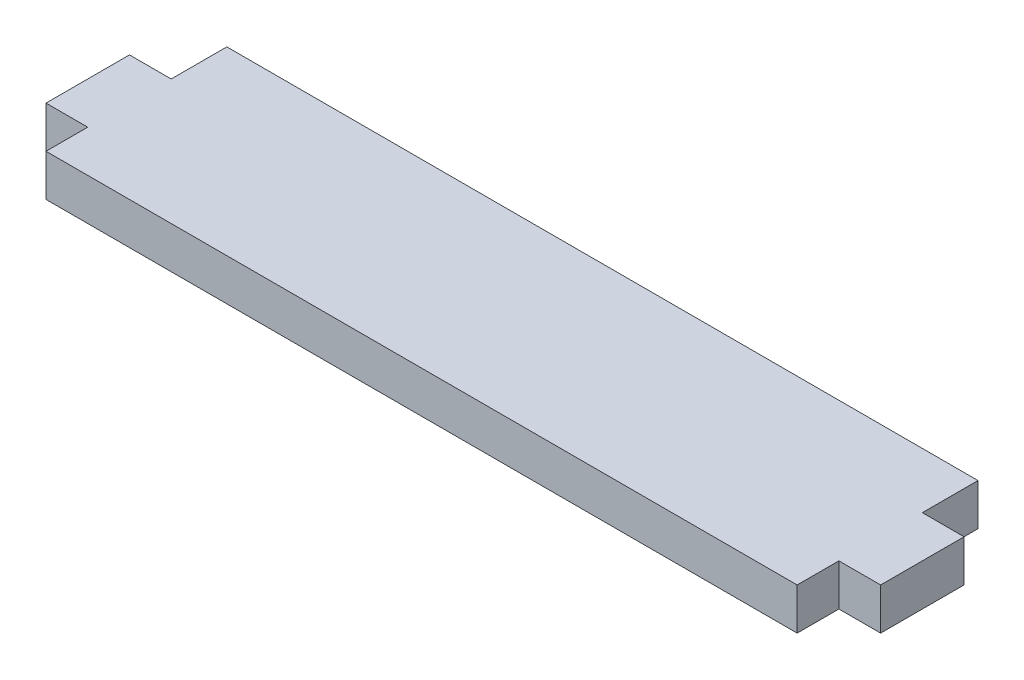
ISO-10303-21;
HEADER;
FILE_DESCRIPTION(('STEP AP214'),'2;1');
FILE_NAME('part.step','',(''),(''),'','','');
FILE_SCHEMA(('AUTOMOTIVE_DESIGN { 1 0 10303 214 1 1 1 1 }'));
ENDSEC;
DATA;
#1=APPLICATION_CONTEXT('core data for automotive mechanical design processes');
#2=APPLICATION_PROTOCOL_DEFINITION('international standard','automotive_design',2000,#1);
#3=PRODUCT_CONTEXT('',#1,'mechanical');
#4=PRODUCT('Part','Part','',(#3));
#5=PRODUCT_RELATED_PRODUCT_CATEGORY('part','',(#4));
#6=PRODUCT_DEFINITION_FORMATION('','',#4);
#7=PRODUCT_DEFINITION_CONTEXT('part definition',#1,'design');
#8=PRODUCT_DEFINITION('design','',#6,#7);
#9=PRODUCT_DEFINITION_SHAPE('','',#8);
#10=(LENGTH_UNIT() NAMED_UNIT(*) SI_UNIT(.MILLI.,.METRE.));
#11=(NAMED_UNIT(*) PLANE_ANGLE_UNIT() SI_UNIT($,.RADIAN.));
#12=(NAMED_UNIT(*) SI_UNIT($,.STERADIAN.) SOLID_ANGLE_UNIT());
#13=UNCERTAINTY_MEASURE_WITH_UNIT(LENGTH_MEASURE(1.E-05),#10,'distance_accuracy_value','');
#14=(GEOMETRIC_REPRESENTATION_CONTEXT(3) GLOBAL_UNCERTAINTY_ASSIGNED_CONTEXT((#13)) GLOBAL_UNIT_ASSIGNED_CONTEXT((#10,
#11,#12)) REPRESENTATION_CONTEXT('',''));
#15=CARTESIAN_POINT('',(0.,0.,0.));
#16=DIRECTION('',(0.,0.,1.));
#17=DIRECTION('',(1.,0.,0.));
#18=AXIS2_PLACEMENT_3D('',#15,#16,#17);
#19=CARTESIAN_POINT('',(27.,3.,-6.5));
#20=DIRECTION('',(-1.,0.,0.));
#21=DIRECTION('',(0.,0.,1.));
#22=AXIS2_PLACEMENT_3D('',#19,#20,#21);
#23=PLANE('',#22);
#24=DIRECTION('',(0.,-1.,0.));
#25=VECTOR('',#24,1.);
#26=CARTESIAN_POINT('',(27.,3.,3.5));
#27=LINE('',#26,#25);
#28=CARTESIAN_POINT('',(27.,3.,3.5));
#29=VERTEX_POINT('',#28);
#30=CARTESIAN_POINT('',(27.,0.,3.5));
#31=VERTEX_POINT('',#30);
#32=EDGE_CURVE('E151',#29,#31,#27,.T.);
#33=ORIENTED_EDGE('',*,*,#32,.F.);
#34=DIRECTION('',(0.,0.,-1.));
#35=VECTOR('',#34,1.);
#36=CARTESIAN_POINT('',(27.,3.,-6.5));
#37=LINE('',#36,#35);
#38=CARTESIAN_POINT('',(27.,3.,6.5));
#39=VERTEX_POINT('',#38);
#40=EDGE_CURVE('E197',#39,#29,#37,.T.);
#41=ORIENTED_EDGE('',*,*,#40,.F.);
#42=DIRECTION('',(0.,-1.,0.));
#43=VECTOR('',#42,1.);
#44=CARTESIAN_POINT('',(27.,3.,6.5));
#45=LINE('',#44,#43);
#46=CARTESIAN_POINT('',(27.,0.,6.5));
#47=VERTEX_POINT('',#46);
#48=EDGE_CURVE('E224',#39,#47,#45,.T.);
#49=ORIENTED_EDGE('',*,*,#48,.T.);
#50=DIRECTION('',(0.,0.,-1.));
#51=VECTOR('',#50,1.);
#52=CARTESIAN_POINT('',(27.,0.,-6.5));
#53=LINE('',#52,#51);
#54=EDGE_CURVE('E201',#47,#31,#53,.T.);
#55=ORIENTED_EDGE('',*,*,#54,.T.);
#56=EDGE_LOOP('',(#33,#41,#49,#55));
#57=FACE_BOUND('',#56,.T.);
#58=ADVANCED_FACE('F33',(#57),#23,.F.);
#59=CARTESIAN_POINT('',(-27.,3.,-6.5));
#60=DIRECTION('',(1.,0.,0.));
#61=DIRECTION('',(0.,0.,-1.));
#62=AXIS2_PLACEMENT_3D('',#59,#60,#61);
#63=PLANE('',#62);
#64=DIRECTION('',(0.,-1.,0.));
#65=VECTOR('',#64,1.);
#66=CARTESIAN_POINT('',(-27.,3.,-2.5));
#67=LINE('',#66,#65);
#68=CARTESIAN_POINT('',(-27.,3.,-2.5));
#69=VERTEX_POINT('',#68);
#70=CARTESIAN_POINT('',(-27.,0.,-2.5));
#71=VERTEX_POINT('',#70);
#72=EDGE_CURVE('E182',#69,#71,#67,.T.);
#73=ORIENTED_EDGE('',*,*,#72,.F.);
#74=DIRECTION('',(0.,0.,1.));
#75=VECTOR('',#74,1.);
#76=CARTESIAN_POINT('',(-27.,3.,-6.5));
#77=LINE('',#76,#75);
#78=CARTESIAN_POINT('',(-27.,3.,-6.5));
#79=VERTEX_POINT('',#78);
#80=EDGE_CURVE('E231',#79,#69,#77,.T.);
#81=ORIENTED_EDGE('',*,*,#80,.F.);
#82=DIRECTION('',(0.,-1.,0.));
#83=VECTOR('',#82,1.);
#84=CARTESIAN_POINT('',(-27.,3.,-6.5));
#85=LINE('',#84,#83);
#86=CARTESIAN_POINT('',(-27.,0.,-6.5));
#87=VERTEX_POINT('',#86);
#88=EDGE_CURVE('E42',#79,#87,#85,.T.);
#89=ORIENTED_EDGE('',*,*,#88,.T.);
#90=DIRECTION('',(0.,0.,1.));
#91=VECTOR('',#90,1.);
#92=CARTESIAN_POINT('',(-27.,0.,-6.5));
#93=LINE('',#92,#91);
#94=EDGE_CURVE('E217',#87,#71,#93,.T.);
#95=ORIENTED_EDGE('',*,*,#94,.T.);
#96=EDGE_LOOP('',(#73,#81,#89,#95));
#97=FACE_BOUND('',#96,.T.);
#98=ADVANCED_FACE('F248',(#97),#63,.F.);
#99=CARTESIAN_POINT('',(27.,3.,-2.5));
#100=VERTEX_POINT('',#99);
#101=CARTESIAN_POINT('',(27.,3.,-6.5));
#102=VERTEX_POINT('',#101);
#103=EDGE_CURVE('E195',#100,#102,#37,.T.);
#104=ORIENTED_EDGE('',*,*,#103,.F.);
#105=DIRECTION('',(0.,-1.,0.));
#106=VECTOR('',#105,1.);
#107=CARTESIAN_POINT('',(27.,3.,-2.5));
#108=LINE('',#107,#106);
#109=CARTESIAN_POINT('',(27.,0.,-2.5));
#110=VERTEX_POINT('',#109);
#111=EDGE_CURVE('E130',#100,#110,#108,.T.);
#112=ORIENTED_EDGE('',*,*,#111,.T.);
#113=CARTESIAN_POINT('',(27.,0.,-6.5));
#114=VERTEX_POINT('',#113);
#115=EDGE_CURVE('E185',#110,#114,#53,.T.);
#116=ORIENTED_EDGE('',*,*,#115,.T.);
#117=DIRECTION('',(0.,-1.,0.));
#118=VECTOR('',#117,1.);
#119=CARTESIAN_POINT('',(27.,3.,-6.5));
#120=LINE('',#119,#118);
#121=EDGE_CURVE('E11',#102,#114,#120,.T.);
#122=ORIENTED_EDGE('',*,*,#121,.F.);
#123=EDGE_LOOP('',(#104,#112,#116,#122));
#124=FACE_BOUND('',#123,.T.);
#125=ADVANCED_FACE('F35',(#124),#23,.F.);
#126=CARTESIAN_POINT('',(-27.,3.,-6.5));
#127=DIRECTION('',(0.,0.,1.));
#128=DIRECTION('',(1.,0.,0.));
#129=AXIS2_PLACEMENT_3D('',#126,#127,#128);
#130=PLANE('',#129);
#131=DIRECTION('',(-1.,0.,0.));
#132=VECTOR('',#131,1.);
#133=CARTESIAN_POINT('',(-27.,0.,-6.5));
#134=LINE('',#133,#132);
#135=EDGE_CURVE('E206',#114,#87,#134,.T.);
#136=ORIENTED_EDGE('',*,*,#135,.T.);
#137=ORIENTED_EDGE('',*,*,#88,.F.);
#138=DIRECTION('',(-1.,0.,0.));
#139=VECTOR('',#138,1.);
#140=CARTESIAN_POINT('',(-27.,3.,-6.5));
#141=LINE('',#140,#139);
#142=EDGE_CURVE('E192',#102,#79,#141,.T.);
#143=ORIENTED_EDGE('',*,*,#142,.F.);
#144=ORIENTED_EDGE('',*,*,#121,.T.);
#145=EDGE_LOOP('',(#136,#137,#143,#144));
#146=FACE_BOUND('',#145,.T.);
#147=ADVANCED_FACE('F243',(#146),#130,.F.);
#148=CARTESIAN_POINT('',(-27.,3.,3.5));
#149=VERTEX_POINT('',#148);
#150=CARTESIAN_POINT('',(-27.,3.,6.5));
#151=VERTEX_POINT('',#150);
#152=EDGE_CURVE('E170',#149,#151,#77,.T.);
#153=ORIENTED_EDGE('',*,*,#152,.F.);
#154=DIRECTION('',(0.,-1.,0.));
#155=VECTOR('',#154,1.);
#156=CARTESIAN_POINT('',(-27.,3.,3.5));
#157=LINE('',#156,#155);
#158=CARTESIAN_POINT('',(-27.,0.,3.49999999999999));
#159=VERTEX_POINT('',#158);
#160=EDGE_CURVE('E167',#149,#159,#157,.T.);
#161=ORIENTED_EDGE('',*,*,#160,.T.);
#162=CARTESIAN_POINT('',(-27.,0.,6.5));
#163=VERTEX_POINT('',#162);
#164=EDGE_CURVE('E209',#159,#163,#93,.T.);
#165=ORIENTED_EDGE('',*,*,#164,.T.);
#166=DIRECTION('',(0.,-1.,0.));
#167=VECTOR('',#166,1.);
#168=CARTESIAN_POINT('',(-27.,3.,6.5));
#169=LINE('',#168,#167);
#170=EDGE_CURVE('E222',#151,#163,#169,.T.);
#171=ORIENTED_EDGE('',*,*,#170,.F.);
#172=EDGE_LOOP('',(#153,#161,#165,#171));
#173=FACE_BOUND('',#172,.T.);
#174=ADVANCED_FACE('F262',(#173),#63,.F.);
#175=CARTESIAN_POINT('',(-27.,3.,6.5));
#176=DIRECTION('',(0.,0.,-1.));
#177=DIRECTION('',(-1.,0.,0.));
#178=AXIS2_PLACEMENT_3D('',#175,#176,#177);
#179=PLANE('',#178);
#180=DIRECTION('',(1.,0.,0.));
#181=VECTOR('',#180,1.);
#182=CARTESIAN_POINT('',(-27.,0.,6.5));
#183=LINE('',#182,#181);
#184=EDGE_CURVE('E212',#163,#47,#183,.T.);
#185=ORIENTED_EDGE('',*,*,#184,.T.);
#186=ORIENTED_EDGE('',*,*,#48,.F.);
#187=DIRECTION('',(1.,0.,0.));
#188=VECTOR('',#187,1.);
#189=CARTESIAN_POINT('',(-27.,3.,6.5));
#190=LINE('',#189,#188);
#191=EDGE_CURVE('E205',#151,#39,#190,.T.);
#192=ORIENTED_EDGE('',*,*,#191,.F.);
#193=ORIENTED_EDGE('',*,*,#170,.T.);
#194=EDGE_LOOP('',(#185,#186,#192,#193));
#195=FACE_BOUND('',#194,.T.);
#196=ADVANCED_FACE('F265',(#195),#179,.F.);
#197=CARTESIAN_POINT('',(27.,3.,6.5));
#198=DIRECTION('',(0.,1.,0.));
#199=DIRECTION('',(0.,0.,1.));
#200=AXIS2_PLACEMENT_3D('',#197,#198,#199);
#201=PLANE('',#200);
#202=ORIENTED_EDGE('',*,*,#40,.T.);
#203=DIRECTION('',(1.,0.,0.));
#204=VECTOR('',#203,1.);
#205=CARTESIAN_POINT('',(30.,3.,3.5));
#206=LINE('',#205,#204);
#207=CARTESIAN_POINT('',(30.,3.,3.5));
#208=VERTEX_POINT('',#207);
#209=EDGE_CURVE('E133',#29,#208,#206,.T.);
#210=ORIENTED_EDGE('',*,*,#209,.T.);
#211=DIRECTION('',(0.,0.,-1.));
#212=VECTOR('',#211,1.);
#213=CARTESIAN_POINT('',(30.,3.,-2.5));
#214=LINE('',#213,#212);
#215=CARTESIAN_POINT('',(30.,3.,-2.5));
#216=VERTEX_POINT('',#215);
#217=EDGE_CURVE('E134',#208,#216,#214,.T.);
#218=ORIENTED_EDGE('',*,*,#217,.T.);
#219=DIRECTION('',(-1.,0.,0.));
#220=VECTOR('',#219,1.);
#221=CARTESIAN_POINT('',(30.,3.,-2.5));
#222=LINE('',#221,#220);
#223=EDGE_CURVE('E124',#216,#100,#222,.T.);
#224=ORIENTED_EDGE('',*,*,#223,.T.);
#225=ORIENTED_EDGE('',*,*,#103,.T.);
#226=ORIENTED_EDGE('',*,*,#142,.T.);
#227=ORIENTED_EDGE('',*,*,#80,.T.);
#228=DIRECTION('',(-1.,0.,0.));
#229=VECTOR('',#228,1.);
#230=CARTESIAN_POINT('',(-30.,3.,-2.5));
#231=LINE('',#230,#229);
#232=CARTESIAN_POINT('',(-30.,3.,-2.5));
#233=VERTEX_POINT('',#232);
#234=EDGE_CURVE('E160',#69,#233,#231,.T.);
#235=ORIENTED_EDGE('',*,*,#234,.T.);
#236=DIRECTION('',(0.,0.,1.));
#237=VECTOR('',#236,1.);
#238=CARTESIAN_POINT('',(-30.,3.,-2.5));
#239=LINE('',#238,#237);
#240=CARTESIAN_POINT('',(-30.,3.,3.5));
#241=VERTEX_POINT('',#240);
#242=EDGE_CURVE('E157',#233,#241,#239,.T.);
#243=ORIENTED_EDGE('',*,*,#242,.T.);
#244=DIRECTION('',(1.,0.,0.));
#245=VECTOR('',#244,1.);
#246=CARTESIAN_POINT('',(-30.,3.,3.5));
#247=LINE('',#246,#245);
#248=EDGE_CURVE('E159',#241,#149,#247,.T.);
#249=ORIENTED_EDGE('',*,*,#248,.T.);
#250=ORIENTED_EDGE('',*,*,#152,.T.);
#251=ORIENTED_EDGE('',*,*,#191,.T.);
#252=EDGE_LOOP('',(#202,#210,#218,#224,#225,#226,#227,#235,#243,#249,#250,#251));
#253=FACE_BOUND('',#252,.T.);
#254=ADVANCED_FACE('F138',(#253),#201,.T.);
#255=CARTESIAN_POINT('',(27.,0.,6.5));
#256=DIRECTION('',(0.,1.,0.));
#257=DIRECTION('',(0.,0.,1.));
#258=AXIS2_PLACEMENT_3D('',#255,#256,#257);
#259=PLANE('',#258);
#260=ORIENTED_EDGE('',*,*,#54,.F.);
#261=ORIENTED_EDGE('',*,*,#184,.F.);
#262=ORIENTED_EDGE('',*,*,#164,.F.);
#263=DIRECTION('',(1.,0.,0.));
#264=VECTOR('',#263,1.);
#265=CARTESIAN_POINT('',(-30.,0.,3.5));
#266=LINE('',#265,#264);
#267=CARTESIAN_POINT('',(-30.,0.,3.5));
#268=VERTEX_POINT('',#267);
#269=EDGE_CURVE('E58',#268,#159,#266,.T.);
#270=ORIENTED_EDGE('',*,*,#269,.F.);
#271=DIRECTION('',(0.,0.,1.));
#272=VECTOR('',#271,1.);
#273=CARTESIAN_POINT('',(-30.,0.,-2.5));
#274=LINE('',#273,#272);
#275=CARTESIAN_POINT('',(-30.,0.,-2.5));
#276=VERTEX_POINT('',#275);
#277=EDGE_CURVE('E149',#276,#268,#274,.T.);
#278=ORIENTED_EDGE('',*,*,#277,.F.);
#279=DIRECTION('',(-1.,0.,0.));
#280=VECTOR('',#279,1.);
#281=CARTESIAN_POINT('',(-30.,0.,-2.5));
#282=LINE('',#281,#280);
#283=EDGE_CURVE('E147',#71,#276,#282,.T.);
#284=ORIENTED_EDGE('',*,*,#283,.F.);
#285=ORIENTED_EDGE('',*,*,#94,.F.);
#286=ORIENTED_EDGE('',*,*,#135,.F.);
#287=ORIENTED_EDGE('',*,*,#115,.F.);
#288=DIRECTION('',(-1.,0.,0.));
#289=VECTOR('',#288,1.);
#290=CARTESIAN_POINT('',(30.,0.,-2.5));
#291=LINE('',#290,#289);
#292=CARTESIAN_POINT('',(30.,0.,-2.5));
#293=VERTEX_POINT('',#292);
#294=EDGE_CURVE('E50',#293,#110,#291,.T.);
#295=ORIENTED_EDGE('',*,*,#294,.F.);
#296=DIRECTION('',(0.,0.,-1.));
#297=VECTOR('',#296,1.);
#298=CARTESIAN_POINT('',(30.,0.,-2.5));
#299=LINE('',#298,#297);
#300=CARTESIAN_POINT('',(30.,0.,3.5));
#301=VERTEX_POINT('',#300);
#302=EDGE_CURVE('E146',#301,#293,#299,.T.);
#303=ORIENTED_EDGE('',*,*,#302,.F.);
#304=DIRECTION('',(1.,0.,0.));
#305=VECTOR('',#304,1.);
#306=CARTESIAN_POINT('',(30.,0.,3.5));
#307=LINE('',#306,#305);
#308=EDGE_CURVE('E142',#31,#301,#307,.T.);
#309=ORIENTED_EDGE('',*,*,#308,.F.);
#310=EDGE_LOOP('',(#260,#261,#262,#270,#278,#284,#285,#286,#287,#295,#303,#309));
#311=FACE_BOUND('',#310,.T.);
#312=ADVANCED_FACE('F284',(#311),#259,.F.);
#313=CARTESIAN_POINT('',(-30.,3.,-2.5));
#314=DIRECTION('',(0.,0.,1.));
#315=DIRECTION('',(1.,0.,0.));
#316=AXIS2_PLACEMENT_3D('',#313,#314,#315);
#317=PLANE('',#316);
#318=ORIENTED_EDGE('',*,*,#283,.T.);
#319=DIRECTION('',(0.,-1.,0.));
#320=VECTOR('',#319,1.);
#321=CARTESIAN_POINT('',(-30.,3.,-2.5));
#322=LINE('',#321,#320);
#323=EDGE_CURVE('E186',#233,#276,#322,.T.);
#324=ORIENTED_EDGE('',*,*,#323,.F.);
#325=ORIENTED_EDGE('',*,*,#234,.F.);
#326=ORIENTED_EDGE('',*,*,#72,.T.);
#327=EDGE_LOOP('',(#318,#324,#325,#326));
#328=FACE_BOUND('',#327,.T.);
#329=ADVANCED_FACE('F250',(#328),#317,.F.);
#330=CARTESIAN_POINT('',(-30.,3.,-2.5));
#331=DIRECTION('',(1.,0.,0.));
#332=DIRECTION('',(0.,0.,-1.));
#333=AXIS2_PLACEMENT_3D('',#330,#331,#332);
#334=PLANE('',#333);
#335=ORIENTED_EDGE('',*,*,#277,.T.);
#336=DIRECTION('',(0.,-1.,0.));
#337=VECTOR('',#336,1.);
#338=CARTESIAN_POINT('',(-30.,3.,3.5));
#339=LINE('',#338,#337);
#340=EDGE_CURVE('E164',#241,#268,#339,.T.);
#341=ORIENTED_EDGE('',*,*,#340,.F.);
#342=ORIENTED_EDGE('',*,*,#242,.F.);
#343=ORIENTED_EDGE('',*,*,#323,.T.);
#344=EDGE_LOOP('',(#335,#341,#342,#343));
#345=FACE_BOUND('',#344,.T.);
#346=ADVANCED_FACE('F257',(#345),#334,.F.);
#347=CARTESIAN_POINT('',(-30.,3.,3.5));
#348=DIRECTION('',(0.,0.,-1.));
#349=DIRECTION('',(-1.,0.,0.));
#350=AXIS2_PLACEMENT_3D('',#347,#348,#349);
#351=PLANE('',#350);
#352=ORIENTED_EDGE('',*,*,#269,.T.);
#353=ORIENTED_EDGE('',*,*,#160,.F.);
#354=ORIENTED_EDGE('',*,*,#248,.F.);
#355=ORIENTED_EDGE('',*,*,#340,.T.);
#356=EDGE_LOOP('',(#352,#353,#354,#355));
#357=FACE_BOUND('',#356,.T.);
#358=ADVANCED_FACE('F259',(#357),#351,.F.);
#359=CARTESIAN_POINT('',(30.,3.,-2.5));
#360=DIRECTION('',(-1.,0.,0.));
#361=DIRECTION('',(0.,0.,1.));
#362=AXIS2_PLACEMENT_3D('',#359,#360,#361);
#363=PLANE('',#362);
#364=ORIENTED_EDGE('',*,*,#302,.T.);
#365=DIRECTION('',(0.,-1.,0.));
#366=VECTOR('',#365,1.);
#367=CARTESIAN_POINT('',(30.,3.,-2.5));
#368=LINE('',#367,#366);
#369=EDGE_CURVE('E128',#216,#293,#368,.T.);
#370=ORIENTED_EDGE('',*,*,#369,.F.);
#371=ORIENTED_EDGE('',*,*,#217,.F.);
#372=DIRECTION('',(0.,-1.,0.));
#373=VECTOR('',#372,1.);
#374=CARTESIAN_POINT('',(30.,3.,3.5));
#375=LINE('',#374,#373);
#376=EDGE_CURVE('E269',#208,#301,#375,.T.);
#377=ORIENTED_EDGE('',*,*,#376,.T.);
#378=EDGE_LOOP('',(#364,#370,#371,#377));
#379=FACE_BOUND('',#378,.T.);
#380=ADVANCED_FACE('F144',(#379),#363,.F.);
#381=CARTESIAN_POINT('',(30.,3.,-2.5));
#382=DIRECTION('',(0.,0.,1.));
#383=DIRECTION('',(1.,0.,0.));
#384=AXIS2_PLACEMENT_3D('',#381,#382,#383);
#385=PLANE('',#384);
#386=ORIENTED_EDGE('',*,*,#294,.T.);
#387=ORIENTED_EDGE('',*,*,#111,.F.);
#388=ORIENTED_EDGE('',*,*,#223,.F.);
#389=ORIENTED_EDGE('',*,*,#369,.T.);
#390=EDGE_LOOP('',(#386,#387,#388,#389));
#391=FACE_BOUND('',#390,.T.);
#392=ADVANCED_FACE('F126',(#391),#385,.F.);
#393=CARTESIAN_POINT('',(30.,3.,3.5));
#394=DIRECTION('',(0.,0.,-1.));
#395=DIRECTION('',(-1.,0.,0.));
#396=AXIS2_PLACEMENT_3D('',#393,#394,#395);
#397=PLANE('',#396);
#398=ORIENTED_EDGE('',*,*,#308,.T.);
#399=ORIENTED_EDGE('',*,*,#376,.F.);
#400=ORIENTED_EDGE('',*,*,#209,.F.);
#401=ORIENTED_EDGE('',*,*,#32,.T.);
#402=EDGE_LOOP('',(#398,#399,#400,#401));
#403=FACE_BOUND('',#402,.T.);
#404=ADVANCED_FACE('F282',(#403),#397,.F.);
#405=CLOSED_SHELL('',(#58,#98,#125,#147,#174,#196,#254,#312,#329,#346,#358,#380,#392,#404));
#406=MANIFOLD_SOLID_BREP('B2',#405);
#407=ADVANCED_BREP_SHAPE_REPRESENTATION('',(#18,#406),#14);
#408=SHAPE_DEFINITION_REPRESENTATION(#9,#407);
ENDSEC;
END-ISO-10303-21;
